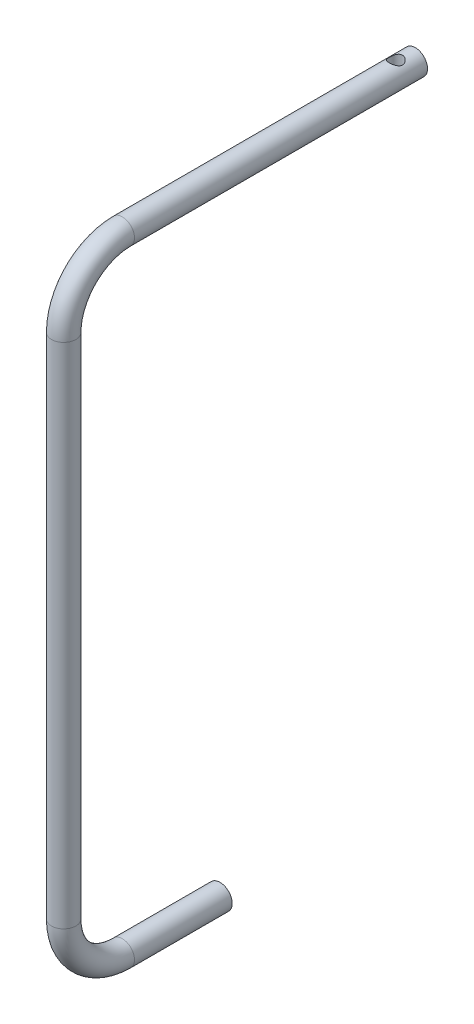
from build123d import *

# Parameters (mm, degrees)
SKETCH1_R          = 3.96875
SKETCH4_R          = 2.159
CUT_EXTRUDE1_DEPTH = 5.08


with BuildPart() as part:
    # Sweep1: sweep along a path in Sketch2
    with BuildLine(Plane(origin=(0, 0, 0), x_dir=(0, 0, -1), z_dir=(1, 0, 0))) as sweep1_path:
        Line((0, 0), (-95.25, 0))
        ThreePointArc((-95.25, 0), (-108.720384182, -5.579615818), (-114.3, -19.05))
        Line((-114.3, -19.05), (-114.3, -184.15))
        ThreePointArc((-114.3, -184.15), (-108.720384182, -197.620384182), (-95.25, -203.2))
        Line((-95.25, -203.2), (-63.5, -203.2))
    # Sketch1 → Sweep1 (sweep)
    with BuildSketch(Plane.XY):
        Circle(SKETCH1_R)
    sweep(path=sweep1_path.line)

    # Sketch4 → Cut-Extrude1 (cut, symmetric)
    with BuildSketch(Plane(origin=(0, 0, 0), x_dir=(1, 0, 0), z_dir=(0, 1, 0))):
        with Locations(Location((0, -6.35, 0), (0, 0, 270))):
            Circle(SKETCH4_R)
    extrude(amount=CUT_EXTRUDE1_DEPTH, both=True, mode=Mode.SUBTRACT)


solid = part.part
